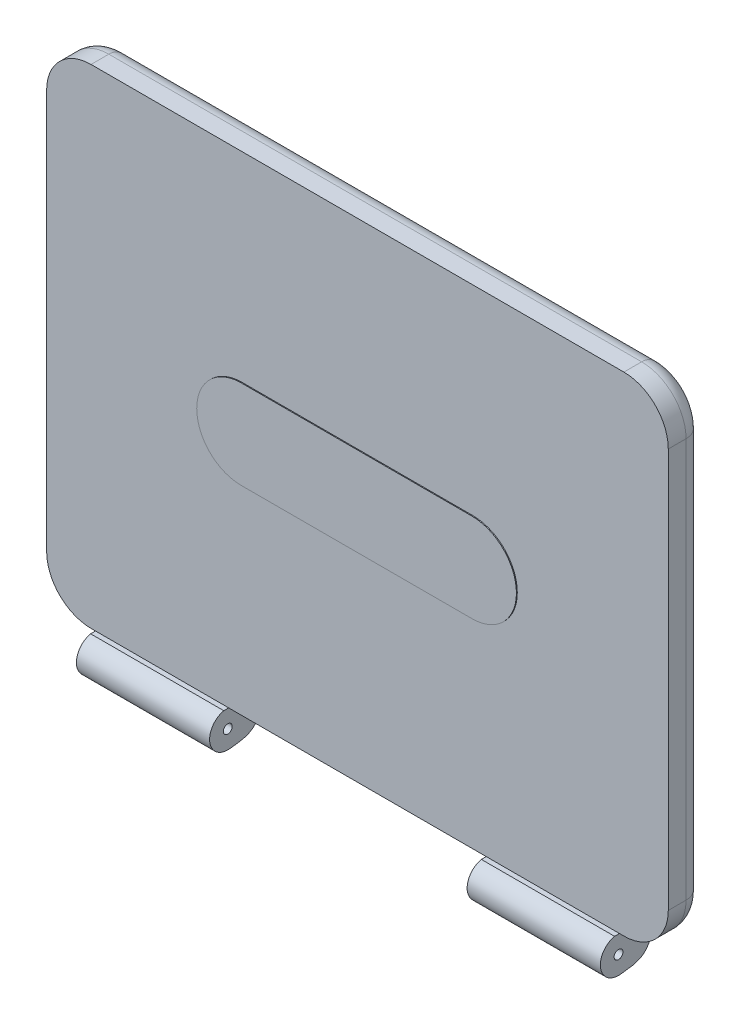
ISO-10303-21;
HEADER;
FILE_DESCRIPTION(('STEP AP214'),'2;1');
FILE_NAME('part.step','',(''),(''),'','','');
FILE_SCHEMA(('AUTOMOTIVE_DESIGN { 1 0 10303 214 1 1 1 1 }'));
ENDSEC;
DATA;
#1=APPLICATION_CONTEXT('core data for automotive mechanical design processes');
#2=APPLICATION_PROTOCOL_DEFINITION('international standard','automotive_design',2000,#1);
#3=PRODUCT_CONTEXT('',#1,'mechanical');
#4=PRODUCT('Part','Part','',(#3));
#5=PRODUCT_RELATED_PRODUCT_CATEGORY('part','',(#4));
#6=PRODUCT_DEFINITION_FORMATION('','',#4);
#7=PRODUCT_DEFINITION_CONTEXT('part definition',#1,'design');
#8=PRODUCT_DEFINITION('design','',#6,#7);
#9=PRODUCT_DEFINITION_SHAPE('','',#8);
#10=(LENGTH_UNIT() NAMED_UNIT(*) SI_UNIT(.MILLI.,.METRE.));
#11=(NAMED_UNIT(*) PLANE_ANGLE_UNIT() SI_UNIT($,.RADIAN.));
#12=(NAMED_UNIT(*) SI_UNIT($,.STERADIAN.) SOLID_ANGLE_UNIT());
#13=UNCERTAINTY_MEASURE_WITH_UNIT(LENGTH_MEASURE(1.E-05),#10,'distance_accuracy_value','');
#14=(GEOMETRIC_REPRESENTATION_CONTEXT(3) GLOBAL_UNCERTAINTY_ASSIGNED_CONTEXT((#13)) GLOBAL_UNIT_ASSIGNED_CONTEXT((#10,
#11,#12)) REPRESENTATION_CONTEXT('',''));
#15=CARTESIAN_POINT('',(0.,0.,0.));
#16=DIRECTION('',(0.,0.,1.));
#17=DIRECTION('',(1.,0.,0.));
#18=AXIS2_PLACEMENT_3D('',#15,#16,#17);
#19=CARTESIAN_POINT('',(5.00000000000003,0.,4.));
#20=DIRECTION('',(0.,1.,0.));
#21=DIRECTION('',(0.,0.,1.));
#22=AXIS2_PLACEMENT_3D('',#19,#20,#21);
#23=PLANE('',#22);
#24=DIRECTION('',(0.,0.,-1.));
#25=VECTOR('',#24,1.);
#26=CARTESIAN_POINT('',(5.49999999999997,0.,4.55000000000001));
#27=LINE('',#26,#25);
#28=CARTESIAN_POINT('',(5.49999999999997,0.,4.));
#29=VERTEX_POINT('',#28);
#30=CARTESIAN_POINT('',(5.49999999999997,0.,2.));
#31=VERTEX_POINT('',#30);
#32=EDGE_CURVE('E250',#29,#31,#27,.T.);
#33=ORIENTED_EDGE('',*,*,#32,.F.);
#34=DIRECTION('',(1.,0.,0.));
#35=VECTOR('',#34,1.);
#36=CARTESIAN_POINT('',(5.00000000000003,0.,4.));
#37=LINE('',#36,#35);
#38=CARTESIAN_POINT('',(5.00000000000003,0.,4.));
#39=VERTEX_POINT('',#38);
#40=EDGE_CURVE('E387',#39,#29,#37,.T.);
#41=ORIENTED_EDGE('',*,*,#40,.F.);
#42=DIRECTION('',(0.,0.,-1.));
#43=VECTOR('',#42,1.);
#44=CARTESIAN_POINT('',(5.00000000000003,0.,4.));
#45=LINE('',#44,#43);
#46=CARTESIAN_POINT('',(5.00000000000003,0.,2.));
#47=VERTEX_POINT('',#46);
#48=EDGE_CURVE('E424',#39,#47,#45,.T.);
#49=ORIENTED_EDGE('',*,*,#48,.T.);
#50=DIRECTION('',(1.,0.,0.));
#51=VECTOR('',#50,1.);
#52=CARTESIAN_POINT('',(65.,0.,2.));
#53=LINE('',#52,#51);
#54=EDGE_CURVE('E432',#47,#31,#53,.T.);
#55=ORIENTED_EDGE('',*,*,#54,.T.);
#56=EDGE_LOOP('',(#33,#41,#49,#55));
#57=FACE_BOUND('',#56,.T.);
#58=ADVANCED_FACE('F31',(#57),#23,.F.);
#59=CARTESIAN_POINT('',(20.5,0.,4.));
#60=VERTEX_POINT('',#59);
#61=CARTESIAN_POINT('',(49.5,0.,4.));
#62=VERTEX_POINT('',#61);
#63=EDGE_CURVE('E391',#60,#62,#37,.T.);
#64=ORIENTED_EDGE('',*,*,#63,.F.);
#65=DIRECTION('',(0.,0.,-1.));
#66=VECTOR('',#65,1.);
#67=CARTESIAN_POINT('',(20.5,0.,4.00000000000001));
#68=LINE('',#67,#66);
#69=CARTESIAN_POINT('',(20.5,0.,2.));
#70=VERTEX_POINT('',#69);
#71=EDGE_CURVE('E210',#60,#70,#68,.T.);
#72=ORIENTED_EDGE('',*,*,#71,.T.);
#73=CARTESIAN_POINT('',(49.5,0.,2.));
#74=VERTEX_POINT('',#73);
#75=EDGE_CURVE('E56',#70,#74,#53,.T.);
#76=ORIENTED_EDGE('',*,*,#75,.T.);
#77=DIRECTION('',(0.,0.,-1.));
#78=VECTOR('',#77,1.);
#79=CARTESIAN_POINT('',(49.5,0.,4.));
#80=LINE('',#79,#78);
#81=EDGE_CURVE('E321',#62,#74,#80,.T.);
#82=ORIENTED_EDGE('',*,*,#81,.F.);
#83=EDGE_LOOP('',(#64,#72,#76,#82));
#84=FACE_BOUND('',#83,.T.);
#85=ADVANCED_FACE('F558',(#84),#23,.F.);
#86=CARTESIAN_POINT('',(5.,5.,4.));
#87=DIRECTION('',(0.,0.,-1.));
#88=DIRECTION('',(-1.,0.,0.));
#89=AXIS2_PLACEMENT_3D('',#86,#87,#88);
#90=PLANE('',#89);
#91=CARTESIAN_POINT('',(5.,5.,4.));
#92=DIRECTION('',(0.,0.,1.));
#93=DIRECTION('',(-1.,0.,0.));
#94=AXIS2_PLACEMENT_3D('',#91,#92,#93);
#95=CIRCLE('',#94,5.);
#96=CARTESIAN_POINT('',(0.,5.00000000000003,4.));
#97=VERTEX_POINT('',#96);
#98=EDGE_CURVE('E383',#97,#39,#95,.T.);
#99=ORIENTED_EDGE('',*,*,#98,.T.);
#100=ORIENTED_EDGE('',*,*,#40,.T.);
#101=EDGE_CURVE('E223',#29,#60,#37,.T.);
#102=ORIENTED_EDGE('',*,*,#101,.T.);
#103=ORIENTED_EDGE('',*,*,#63,.T.);
#104=DIRECTION('',(-1.,0.,0.));
#105=VECTOR('',#104,1.);
#106=CARTESIAN_POINT('',(64.5,0.,4.));
#107=LINE('',#106,#105);
#108=CARTESIAN_POINT('',(64.5,0.,4.));
#109=VERTEX_POINT('',#108);
#110=EDGE_CURVE('E315',#109,#62,#107,.T.);
#111=ORIENTED_EDGE('',*,*,#110,.F.);
#112=CARTESIAN_POINT('',(65.,0.,4.));
#113=VERTEX_POINT('',#112);
#114=EDGE_CURVE('E386',#109,#113,#37,.T.);
#115=ORIENTED_EDGE('',*,*,#114,.T.);
#116=CARTESIAN_POINT('',(65.,5.,4.));
#117=DIRECTION('',(0.,0.,1.));
#118=DIRECTION('',(1.,0.,0.));
#119=AXIS2_PLACEMENT_3D('',#116,#117,#118);
#120=CIRCLE('',#119,5.);
#121=CARTESIAN_POINT('',(70.,5.00000000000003,4.));
#122=VERTEX_POINT('',#121);
#123=EDGE_CURVE('E390',#113,#122,#120,.T.);
#124=ORIENTED_EDGE('',*,*,#123,.T.);
#125=DIRECTION('',(0.,1.,0.));
#126=VECTOR('',#125,1.);
#127=CARTESIAN_POINT('',(70.,5.00000000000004,4.));
#128=LINE('',#127,#126);
#129=CARTESIAN_POINT('',(70.,50.,4.));
#130=VERTEX_POINT('',#129);
#131=EDGE_CURVE('E393',#122,#130,#128,.T.);
#132=ORIENTED_EDGE('',*,*,#131,.T.);
#133=CARTESIAN_POINT('',(65.,50.,4.));
#134=DIRECTION('',(0.,0.,1.));
#135=DIRECTION('',(-1.,0.,0.));
#136=AXIS2_PLACEMENT_3D('',#133,#134,#135);
#137=CIRCLE('',#136,5.);
#138=CARTESIAN_POINT('',(65.,55.,4.));
#139=VERTEX_POINT('',#138);
#140=EDGE_CURVE('E395',#130,#139,#137,.T.);
#141=ORIENTED_EDGE('',*,*,#140,.T.);
#142=DIRECTION('',(-1.,0.,0.));
#143=VECTOR('',#142,1.);
#144=CARTESIAN_POINT('',(5.00000000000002,55.,4.));
#145=LINE('',#144,#143);
#146=CARTESIAN_POINT('',(5.00000000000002,55.,4.));
#147=VERTEX_POINT('',#146);
#148=EDGE_CURVE('E397',#139,#147,#145,.T.);
#149=ORIENTED_EDGE('',*,*,#148,.T.);
#150=CARTESIAN_POINT('',(4.99999999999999,50.,4.));
#151=DIRECTION('',(0.,0.,1.));
#152=DIRECTION('',(-1.,0.,0.));
#153=AXIS2_PLACEMENT_3D('',#150,#151,#152);
#154=CIRCLE('',#153,5.);
#155=CARTESIAN_POINT('',(0.,50.,4.));
#156=VERTEX_POINT('',#155);
#157=EDGE_CURVE('E399',#147,#156,#154,.T.);
#158=ORIENTED_EDGE('',*,*,#157,.T.);
#159=DIRECTION('',(0.,-1.,0.));
#160=VECTOR('',#159,1.);
#161=CARTESIAN_POINT('',(0.,5.00000000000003,4.));
#162=LINE('',#161,#160);
#163=EDGE_CURVE('E401',#156,#97,#162,.T.);
#164=ORIENTED_EDGE('',*,*,#163,.T.);
#165=EDGE_LOOP('',(#99,#100,#102,#103,#111,#115,#124,#132,#141,#149,#158,#164));
#166=FACE_BOUND('',#165,.T.);
#167=CARTESIAN_POINT('',(22.,27.5,4.));
#168=DIRECTION('',(0.,0.,1.));
#169=DIRECTION('',(1.,0.,0.));
#170=AXIS2_PLACEMENT_3D('',#167,#168,#169);
#171=CIRCLE('',#170,4.99999999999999);
#172=CARTESIAN_POINT('',(22.,32.5,4.));
#173=VERTEX_POINT('',#172);
#174=CARTESIAN_POINT('',(22.,22.5,4.));
#175=VERTEX_POINT('',#174);
#176=EDGE_CURVE('E326',#173,#175,#171,.T.);
#177=ORIENTED_EDGE('',*,*,#176,.F.);
#178=DIRECTION('',(-1.,0.,0.));
#179=VECTOR('',#178,1.);
#180=CARTESIAN_POINT('',(22.,32.5,4.));
#181=LINE('',#180,#179);
#182=CARTESIAN_POINT('',(48.,32.5,4.));
#183=VERTEX_POINT('',#182);
#184=EDGE_CURVE('E335',#183,#173,#181,.T.);
#185=ORIENTED_EDGE('',*,*,#184,.F.);
#186=CARTESIAN_POINT('',(48.,27.5,4.));
#187=DIRECTION('',(0.,0.,1.));
#188=DIRECTION('',(1.,0.,0.));
#189=AXIS2_PLACEMENT_3D('',#186,#187,#188);
#190=CIRCLE('',#189,5.);
#191=CARTESIAN_POINT('',(48.,22.5,4.));
#192=VERTEX_POINT('',#191);
#193=EDGE_CURVE('E332',#192,#183,#190,.T.);
#194=ORIENTED_EDGE('',*,*,#193,.F.);
#195=DIRECTION('',(1.,0.,0.));
#196=VECTOR('',#195,1.);
#197=CARTESIAN_POINT('',(22.,22.5,4.));
#198=LINE('',#197,#196);
#199=EDGE_CURVE('E329',#175,#192,#198,.T.);
#200=ORIENTED_EDGE('',*,*,#199,.F.);
#201=EDGE_LOOP('',(#177,#185,#194,#200));
#202=FACE_BOUND('',#201,.T.);
#203=ADVANCED_FACE('F490',(#166,#202),#90,.F.);
#204=CARTESIAN_POINT('',(5.,5.,4.));
#205=DIRECTION('',(0.,0.,-1.));
#206=DIRECTION('',(-1.,0.,0.));
#207=AXIS2_PLACEMENT_3D('',#204,#205,#206);
#208=CYLINDRICAL_SURFACE('',#207,5.);
#209=DIRECTION('',(0.,0.,-1.));
#210=VECTOR('',#209,1.);
#211=CARTESIAN_POINT('',(0.,5.00000000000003,4.));
#212=LINE('',#211,#210);
#213=CARTESIAN_POINT('',(0.,5.00000000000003,2.));
#214=VERTEX_POINT('',#213);
#215=EDGE_CURVE('E403',#97,#214,#212,.T.);
#216=ORIENTED_EDGE('',*,*,#215,.T.);
#217=CARTESIAN_POINT('',(5.,5.,2.));
#218=DIRECTION('',(0.,0.,-1.));
#219=DIRECTION('',(-1.,0.,0.));
#220=AXIS2_PLACEMENT_3D('',#217,#218,#219);
#221=CIRCLE('',#220,5.);
#222=EDGE_CURVE('E440',#214,#47,#221,.F.);
#223=ORIENTED_EDGE('',*,*,#222,.T.);
#224=ORIENTED_EDGE('',*,*,#48,.F.);
#225=ORIENTED_EDGE('',*,*,#98,.F.);
#226=EDGE_LOOP('',(#216,#223,#224,#225));
#227=FACE_BOUND('',#226,.T.);
#228=ADVANCED_FACE('F33',(#227),#208,.T.);
#229=ORIENTED_EDGE('',*,*,#114,.F.);
#230=DIRECTION('',(0.,0.,-1.));
#231=VECTOR('',#230,1.);
#232=CARTESIAN_POINT('',(64.5,0.,3.99999999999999));
#233=LINE('',#232,#231);
#234=CARTESIAN_POINT('',(64.5,0.,2.));
#235=VERTEX_POINT('',#234);
#236=EDGE_CURVE('E323',#109,#235,#233,.T.);
#237=ORIENTED_EDGE('',*,*,#236,.T.);
#238=CARTESIAN_POINT('',(65.,0.,2.));
#239=VERTEX_POINT('',#238);
#240=EDGE_CURVE('E426',#235,#239,#53,.T.);
#241=ORIENTED_EDGE('',*,*,#240,.T.);
#242=DIRECTION('',(0.,0.,-1.));
#243=VECTOR('',#242,1.);
#244=CARTESIAN_POINT('',(65.,0.,4.));
#245=LINE('',#244,#243);
#246=EDGE_CURVE('E421',#113,#239,#245,.T.);
#247=ORIENTED_EDGE('',*,*,#246,.F.);
#248=EDGE_LOOP('',(#229,#237,#241,#247));
#249=FACE_BOUND('',#248,.T.);
#250=ADVANCED_FACE('F553',(#249),#23,.F.);
#251=CARTESIAN_POINT('',(65.,5.,4.));
#252=DIRECTION('',(0.,0.,-1.));
#253=DIRECTION('',(-1.,0.,0.));
#254=AXIS2_PLACEMENT_3D('',#251,#252,#253);
#255=CYLINDRICAL_SURFACE('',#254,5.);
#256=ORIENTED_EDGE('',*,*,#246,.T.);
#257=CARTESIAN_POINT('',(65.,5.,2.));
#258=DIRECTION('',(0.,0.,-1.));
#259=DIRECTION('',(-1.,0.,0.));
#260=AXIS2_PLACEMENT_3D('',#257,#258,#259);
#261=CIRCLE('',#260,5.);
#262=CARTESIAN_POINT('',(70.,5.00000000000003,2.));
#263=VERTEX_POINT('',#262);
#264=EDGE_CURVE('E452',#239,#263,#261,.F.);
#265=ORIENTED_EDGE('',*,*,#264,.T.);
#266=DIRECTION('',(0.,0.,-1.));
#267=VECTOR('',#266,1.);
#268=CARTESIAN_POINT('',(70.,5.00000000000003,4.));
#269=LINE('',#268,#267);
#270=EDGE_CURVE('E418',#122,#263,#269,.T.);
#271=ORIENTED_EDGE('',*,*,#270,.F.);
#272=ORIENTED_EDGE('',*,*,#123,.F.);
#273=EDGE_LOOP('',(#256,#265,#271,#272));
#274=FACE_BOUND('',#273,.T.);
#275=ADVANCED_FACE('F567',(#274),#255,.T.);
#276=CARTESIAN_POINT('',(70.,5.00000000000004,4.));
#277=DIRECTION('',(-1.,0.,0.));
#278=DIRECTION('',(0.,-1.,0.));
#279=AXIS2_PLACEMENT_3D('',#276,#277,#278);
#280=PLANE('',#279);
#281=ORIENTED_EDGE('',*,*,#270,.T.);
#282=DIRECTION('',(0.,1.,0.));
#283=VECTOR('',#282,1.);
#284=CARTESIAN_POINT('',(70.,50.,2.));
#285=LINE('',#284,#283);
#286=CARTESIAN_POINT('',(70.,50.,2.));
#287=VERTEX_POINT('',#286);
#288=EDGE_CURVE('E450',#263,#287,#285,.T.);
#289=ORIENTED_EDGE('',*,*,#288,.T.);
#290=DIRECTION('',(0.,0.,-1.));
#291=VECTOR('',#290,1.);
#292=CARTESIAN_POINT('',(70.,50.,4.));
#293=LINE('',#292,#291);
#294=EDGE_CURVE('E415',#130,#287,#293,.T.);
#295=ORIENTED_EDGE('',*,*,#294,.F.);
#296=ORIENTED_EDGE('',*,*,#131,.F.);
#297=EDGE_LOOP('',(#281,#289,#295,#296));
#298=FACE_BOUND('',#297,.T.);
#299=ADVANCED_FACE('F572',(#298),#280,.F.);
#300=CARTESIAN_POINT('',(65.,50.,4.));
#301=DIRECTION('',(0.,0.,-1.));
#302=DIRECTION('',(-1.,0.,0.));
#303=AXIS2_PLACEMENT_3D('',#300,#301,#302);
#304=CYLINDRICAL_SURFACE('',#303,5.);
#305=ORIENTED_EDGE('',*,*,#294,.T.);
#306=CARTESIAN_POINT('',(65.,50.,2.));
#307=DIRECTION('',(0.,0.,-1.));
#308=DIRECTION('',(-1.,0.,0.));
#309=AXIS2_PLACEMENT_3D('',#306,#307,#308);
#310=CIRCLE('',#309,5.);
#311=CARTESIAN_POINT('',(65.,55.,2.));
#312=VERTEX_POINT('',#311);
#313=EDGE_CURVE('E448',#287,#312,#310,.F.);
#314=ORIENTED_EDGE('',*,*,#313,.T.);
#315=DIRECTION('',(0.,0.,-1.));
#316=VECTOR('',#315,1.);
#317=CARTESIAN_POINT('',(65.,55.,4.));
#318=LINE('',#317,#316);
#319=EDGE_CURVE('E412',#139,#312,#318,.T.);
#320=ORIENTED_EDGE('',*,*,#319,.F.);
#321=ORIENTED_EDGE('',*,*,#140,.F.);
#322=EDGE_LOOP('',(#305,#314,#320,#321));
#323=FACE_BOUND('',#322,.T.);
#324=ADVANCED_FACE('F837',(#323),#304,.T.);
#325=CARTESIAN_POINT('',(5.00000000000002,55.,4.));
#326=DIRECTION('',(0.,-1.,0.));
#327=DIRECTION('',(0.,0.,-1.));
#328=AXIS2_PLACEMENT_3D('',#325,#326,#327);
#329=PLANE('',#328);
#330=ORIENTED_EDGE('',*,*,#319,.T.);
#331=DIRECTION('',(-1.,0.,0.));
#332=VECTOR('',#331,1.);
#333=CARTESIAN_POINT('',(5.00000000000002,55.,2.));
#334=LINE('',#333,#332);
#335=CARTESIAN_POINT('',(5.00000000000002,55.,2.));
#336=VERTEX_POINT('',#335);
#337=EDGE_CURVE('E446',#312,#336,#334,.T.);
#338=ORIENTED_EDGE('',*,*,#337,.T.);
#339=DIRECTION('',(0.,0.,-1.));
#340=VECTOR('',#339,1.);
#341=CARTESIAN_POINT('',(5.00000000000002,55.,4.));
#342=LINE('',#341,#340);
#343=EDGE_CURVE('E409',#147,#336,#342,.T.);
#344=ORIENTED_EDGE('',*,*,#343,.F.);
#345=ORIENTED_EDGE('',*,*,#148,.F.);
#346=EDGE_LOOP('',(#330,#338,#344,#345));
#347=FACE_BOUND('',#346,.T.);
#348=ADVANCED_FACE('F828',(#347),#329,.F.);
#349=CARTESIAN_POINT('',(4.99999999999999,50.,4.));
#350=DIRECTION('',(0.,0.,-1.));
#351=DIRECTION('',(-1.,0.,0.));
#352=AXIS2_PLACEMENT_3D('',#349,#350,#351);
#353=CYLINDRICAL_SURFACE('',#352,5.);
#354=ORIENTED_EDGE('',*,*,#343,.T.);
#355=CARTESIAN_POINT('',(4.99999999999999,50.,2.));
#356=DIRECTION('',(0.,0.,-1.));
#357=DIRECTION('',(-1.,0.,0.));
#358=AXIS2_PLACEMENT_3D('',#355,#356,#357);
#359=CIRCLE('',#358,5.);
#360=CARTESIAN_POINT('',(0.,50.,2.));
#361=VERTEX_POINT('',#360);
#362=EDGE_CURVE('E444',#336,#361,#359,.F.);
#363=ORIENTED_EDGE('',*,*,#362,.T.);
#364=DIRECTION('',(0.,0.,-1.));
#365=VECTOR('',#364,1.);
#366=CARTESIAN_POINT('',(0.,50.,4.));
#367=LINE('',#366,#365);
#368=EDGE_CURVE('E406',#156,#361,#367,.T.);
#369=ORIENTED_EDGE('',*,*,#368,.F.);
#370=ORIENTED_EDGE('',*,*,#157,.F.);
#371=EDGE_LOOP('',(#354,#363,#369,#370));
#372=FACE_BOUND('',#371,.T.);
#373=ADVANCED_FACE('F819',(#372),#353,.T.);
#374=CARTESIAN_POINT('',(0.,5.00000000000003,4.));
#375=DIRECTION('',(1.,0.,0.));
#376=DIRECTION('',(0.,1.,0.));
#377=AXIS2_PLACEMENT_3D('',#374,#375,#376);
#378=PLANE('',#377);
#379=ORIENTED_EDGE('',*,*,#368,.T.);
#380=DIRECTION('',(0.,-1.,0.));
#381=VECTOR('',#380,1.);
#382=CARTESIAN_POINT('',(0.,5.00000000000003,2.));
#383=LINE('',#382,#381);
#384=EDGE_CURVE('E442',#361,#214,#383,.T.);
#385=ORIENTED_EDGE('',*,*,#384,.T.);
#386=ORIENTED_EDGE('',*,*,#215,.F.);
#387=ORIENTED_EDGE('',*,*,#163,.F.);
#388=EDGE_LOOP('',(#379,#385,#386,#387));
#389=FACE_BOUND('',#388,.T.);
#390=ADVANCED_FACE('F496',(#389),#378,.F.);
#391=CARTESIAN_POINT('',(5.,5.,0.));
#392=DIRECTION('',(0.,0.,-1.));
#393=DIRECTION('',(-1.,0.,0.));
#394=AXIS2_PLACEMENT_3D('',#391,#392,#393);
#395=PLANE('',#394);
#396=CARTESIAN_POINT('',(65.,5.,0.));
#397=DIRECTION('',(0.,0.,-1.));
#398=DIRECTION('',(-1.,0.,0.));
#399=AXIS2_PLACEMENT_3D('',#396,#397,#398);
#400=CIRCLE('',#399,3.);
#401=CARTESIAN_POINT('',(68.,5.00000000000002,0.));
#402=VERTEX_POINT('',#401);
#403=CARTESIAN_POINT('',(65.,2.,0.));
#404=VERTEX_POINT('',#403);
#405=EDGE_CURVE('E456',#402,#404,#400,.T.);
#406=ORIENTED_EDGE('',*,*,#405,.T.);
#407=DIRECTION('',(1.,0.,0.));
#408=VECTOR('',#407,1.);
#409=CARTESIAN_POINT('',(5.00000000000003,2.,0.));
#410=LINE('',#409,#408);
#411=CARTESIAN_POINT('',(5.00000000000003,2.,0.));
#412=VERTEX_POINT('',#411);
#413=EDGE_CURVE('E454',#404,#412,#410,.F.);
#414=ORIENTED_EDGE('',*,*,#413,.T.);
#415=CARTESIAN_POINT('',(5.,5.,0.));
#416=DIRECTION('',(0.,0.,-1.));
#417=DIRECTION('',(-1.,0.,0.));
#418=AXIS2_PLACEMENT_3D('',#415,#416,#417);
#419=CIRCLE('',#418,3.);
#420=CARTESIAN_POINT('',(2.,5.00000000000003,0.));
#421=VERTEX_POINT('',#420);
#422=EDGE_CURVE('E429',#412,#421,#419,.T.);
#423=ORIENTED_EDGE('',*,*,#422,.T.);
#424=DIRECTION('',(0.,-1.,0.));
#425=VECTOR('',#424,1.);
#426=CARTESIAN_POINT('',(1.99999999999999,50.,0.));
#427=LINE('',#426,#425);
#428=CARTESIAN_POINT('',(1.99999999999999,50.,0.));
#429=VERTEX_POINT('',#428);
#430=EDGE_CURVE('E465',#421,#429,#427,.F.);
#431=ORIENTED_EDGE('',*,*,#430,.T.);
#432=CARTESIAN_POINT('',(4.99999999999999,50.,0.));
#433=DIRECTION('',(0.,0.,-1.));
#434=DIRECTION('',(-1.,0.,0.));
#435=AXIS2_PLACEMENT_3D('',#432,#433,#434);
#436=CIRCLE('',#435,3.);
#437=CARTESIAN_POINT('',(5.00000000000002,53.,0.));
#438=VERTEX_POINT('',#437);
#439=EDGE_CURVE('E464',#429,#438,#436,.T.);
#440=ORIENTED_EDGE('',*,*,#439,.T.);
#441=DIRECTION('',(-1.,0.,0.));
#442=VECTOR('',#441,1.);
#443=CARTESIAN_POINT('',(65.,53.,0.));
#444=LINE('',#443,#442);
#445=CARTESIAN_POINT('',(65.,53.,0.));
#446=VERTEX_POINT('',#445);
#447=EDGE_CURVE('E462',#438,#446,#444,.F.);
#448=ORIENTED_EDGE('',*,*,#447,.T.);
#449=CARTESIAN_POINT('',(65.,50.,0.));
#450=DIRECTION('',(0.,0.,-1.));
#451=DIRECTION('',(-1.,0.,0.));
#452=AXIS2_PLACEMENT_3D('',#449,#450,#451);
#453=CIRCLE('',#452,3.);
#454=CARTESIAN_POINT('',(68.,50.,0.));
#455=VERTEX_POINT('',#454);
#456=EDGE_CURVE('E460',#446,#455,#453,.T.);
#457=ORIENTED_EDGE('',*,*,#456,.T.);
#458=DIRECTION('',(0.,1.,0.));
#459=VECTOR('',#458,1.);
#460=CARTESIAN_POINT('',(68.,5.00000000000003,0.));
#461=LINE('',#460,#459);
#462=EDGE_CURVE('E458',#455,#402,#461,.F.);
#463=ORIENTED_EDGE('',*,*,#462,.T.);
#464=EDGE_LOOP('',(#406,#414,#423,#431,#440,#448,#457,#463));
#465=FACE_BOUND('',#464,.T.);
#466=ADVANCED_FACE('F470',(#465),#395,.T.);
#467=CARTESIAN_POINT('',(5.00000000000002,53.,2.));
#468=DIRECTION('',(1.,0.,0.));
#469=DIRECTION('',(0.,0.,-1.));
#470=AXIS2_PLACEMENT_3D('',#467,#468,#469);
#471=CYLINDRICAL_SURFACE('',#470,2.);
#472=CARTESIAN_POINT('',(65.,53.,2.));
#473=DIRECTION('',(1.,0.,0.));
#474=DIRECTION('',(0.,1.,0.));
#475=AXIS2_PLACEMENT_3D('',#472,#473,#474);
#476=CIRCLE('',#475,2.);
#477=EDGE_CURVE('E377',#446,#312,#476,.T.);
#478=ORIENTED_EDGE('',*,*,#477,.F.);
#479=ORIENTED_EDGE('',*,*,#447,.F.);
#480=CARTESIAN_POINT('',(5.00000000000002,53.,2.));
#481=DIRECTION('',(-1.,0.,0.));
#482=DIRECTION('',(0.,0.,1.));
#483=AXIS2_PLACEMENT_3D('',#480,#481,#482);
#484=CIRCLE('',#483,2.);
#485=EDGE_CURVE('E380',#336,#438,#484,.T.);
#486=ORIENTED_EDGE('',*,*,#485,.F.);
#487=ORIENTED_EDGE('',*,*,#337,.F.);
#488=EDGE_LOOP('',(#478,#479,#486,#487));
#489=FACE_BOUND('',#488,.T.);
#490=ADVANCED_FACE('F505',(#489),#471,.T.);
#491=CARTESIAN_POINT('',(4.99999999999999,50.,2.));
#492=DIRECTION('',(0.,0.,-1.));
#493=DIRECTION('',(-1.,0.,0.));
#494=AXIS2_PLACEMENT_3D('',#491,#492,#493);
#495=TOROIDAL_SURFACE('',#494,3.,2.);
#496=ORIENTED_EDGE('',*,*,#485,.T.);
#497=ORIENTED_EDGE('',*,*,#439,.F.);
#498=CARTESIAN_POINT('',(1.99999999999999,50.,2.));
#499=DIRECTION('',(0.,-1.,0.));
#500=DIRECTION('',(1.,0.,0.));
#501=AXIS2_PLACEMENT_3D('',#498,#499,#500);
#502=CIRCLE('',#501,2.);
#503=EDGE_CURVE('E374',#361,#429,#502,.T.);
#504=ORIENTED_EDGE('',*,*,#503,.F.);
#505=ORIENTED_EDGE('',*,*,#362,.F.);
#506=EDGE_LOOP('',(#496,#497,#504,#505));
#507=FACE_BOUND('',#506,.T.);
#508=ADVANCED_FACE('F500',(#507),#495,.T.);
#509=CARTESIAN_POINT('',(65.,50.,2.));
#510=DIRECTION('',(0.,0.,-1.));
#511=DIRECTION('',(-1.,0.,0.));
#512=AXIS2_PLACEMENT_3D('',#509,#510,#511);
#513=TOROIDAL_SURFACE('',#512,3.,2.);
#514=ORIENTED_EDGE('',*,*,#477,.T.);
#515=ORIENTED_EDGE('',*,*,#313,.F.);
#516=CARTESIAN_POINT('',(68.,50.,2.));
#517=DIRECTION('',(0.,-1.,0.));
#518=DIRECTION('',(0.,0.,-1.));
#519=AXIS2_PLACEMENT_3D('',#516,#517,#518);
#520=CIRCLE('',#519,2.);
#521=EDGE_CURVE('E371',#455,#287,#520,.T.);
#522=ORIENTED_EDGE('',*,*,#521,.F.);
#523=ORIENTED_EDGE('',*,*,#456,.F.);
#524=EDGE_LOOP('',(#514,#515,#522,#523));
#525=FACE_BOUND('',#524,.T.);
#526=ADVANCED_FACE('F511',(#525),#513,.T.);
#527=CARTESIAN_POINT('',(2.,5.00000000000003,2.));
#528=DIRECTION('',(0.,1.,0.));
#529=DIRECTION('',(-1.,0.,0.));
#530=AXIS2_PLACEMENT_3D('',#527,#528,#529);
#531=CYLINDRICAL_SURFACE('',#530,2.);
#532=ORIENTED_EDGE('',*,*,#503,.T.);
#533=ORIENTED_EDGE('',*,*,#430,.F.);
#534=CARTESIAN_POINT('',(2.,5.00000000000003,2.));
#535=DIRECTION('',(0.,-1.,0.));
#536=DIRECTION('',(1.,0.,0.));
#537=AXIS2_PLACEMENT_3D('',#534,#535,#536);
#538=CIRCLE('',#537,2.);
#539=EDGE_CURVE('E368',#214,#421,#538,.T.);
#540=ORIENTED_EDGE('',*,*,#539,.F.);
#541=ORIENTED_EDGE('',*,*,#384,.F.);
#542=EDGE_LOOP('',(#532,#533,#540,#541));
#543=FACE_BOUND('',#542,.T.);
#544=ADVANCED_FACE('F476',(#543),#531,.T.);
#545=CARTESIAN_POINT('',(68.,5.00000000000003,2.));
#546=DIRECTION('',(0.,-1.,0.));
#547=DIRECTION('',(1.,0.,0.));
#548=AXIS2_PLACEMENT_3D('',#545,#546,#547);
#549=CYLINDRICAL_SURFACE('',#548,2.);
#550=ORIENTED_EDGE('',*,*,#521,.T.);
#551=ORIENTED_EDGE('',*,*,#288,.F.);
#552=CARTESIAN_POINT('',(68.,5.00000000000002,2.));
#553=DIRECTION('',(0.,-1.,0.));
#554=DIRECTION('',(1.,0.,0.));
#555=AXIS2_PLACEMENT_3D('',#552,#553,#554);
#556=CIRCLE('',#555,2.);
#557=EDGE_CURVE('E365',#402,#263,#556,.T.);
#558=ORIENTED_EDGE('',*,*,#557,.F.);
#559=ORIENTED_EDGE('',*,*,#462,.F.);
#560=EDGE_LOOP('',(#550,#551,#558,#559));
#561=FACE_BOUND('',#560,.T.);
#562=ADVANCED_FACE('F517',(#561),#549,.T.);
#563=CARTESIAN_POINT('',(5.,5.,2.));
#564=DIRECTION('',(0.,0.,-1.));
#565=DIRECTION('',(-1.,0.,0.));
#566=AXIS2_PLACEMENT_3D('',#563,#564,#565);
#567=TOROIDAL_SURFACE('',#566,3.,2.);
#568=ORIENTED_EDGE('',*,*,#539,.T.);
#569=ORIENTED_EDGE('',*,*,#422,.F.);
#570=CARTESIAN_POINT('',(5.00000000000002,2.,2.));
#571=DIRECTION('',(1.,0.,0.));
#572=DIRECTION('',(0.,0.,-1.));
#573=AXIS2_PLACEMENT_3D('',#570,#571,#572);
#574=CIRCLE('',#573,2.);
#575=EDGE_CURVE('E362',#47,#412,#574,.T.);
#576=ORIENTED_EDGE('',*,*,#575,.F.);
#577=ORIENTED_EDGE('',*,*,#222,.F.);
#578=EDGE_LOOP('',(#568,#569,#576,#577));
#579=FACE_BOUND('',#578,.T.);
#580=ADVANCED_FACE('F480',(#579),#567,.T.);
#581=CARTESIAN_POINT('',(65.,5.,2.));
#582=DIRECTION('',(0.,0.,-1.));
#583=DIRECTION('',(-1.,0.,0.));
#584=AXIS2_PLACEMENT_3D('',#581,#582,#583);
#585=TOROIDAL_SURFACE('',#584,3.,2.);
#586=ORIENTED_EDGE('',*,*,#557,.T.);
#587=ORIENTED_EDGE('',*,*,#264,.F.);
#588=CARTESIAN_POINT('',(65.,2.,2.));
#589=DIRECTION('',(-1.,0.,0.));
#590=DIRECTION('',(0.,0.,1.));
#591=AXIS2_PLACEMENT_3D('',#588,#589,#590);
#592=CIRCLE('',#591,2.);
#593=EDGE_CURVE('E359',#404,#239,#592,.T.);
#594=ORIENTED_EDGE('',*,*,#593,.F.);
#595=ORIENTED_EDGE('',*,*,#405,.F.);
#596=EDGE_LOOP('',(#586,#587,#594,#595));
#597=FACE_BOUND('',#596,.T.);
#598=ADVANCED_FACE('F521',(#597),#585,.T.);
#599=CARTESIAN_POINT('',(5.00000000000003,2.,2.));
#600=DIRECTION('',(-1.,0.,0.));
#601=DIRECTION('',(0.,0.,1.));
#602=AXIS2_PLACEMENT_3D('',#599,#600,#601);
#603=CYLINDRICAL_SURFACE('',#602,2.);
#604=CARTESIAN_POINT('',(5.49999999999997,2.,2.));
#605=DIRECTION('',(1.,0.,0.));
#606=DIRECTION('',(0.,0.,1.));
#607=AXIS2_PLACEMENT_3D('',#604,#605,#606);
#608=CIRCLE('',#607,2.);
#609=CARTESIAN_POINT('',(5.49999999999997,1.91164594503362,0.00195256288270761));
#610=VERTEX_POINT('',#609);
#611=EDGE_CURVE('E254',#31,#610,#608,.T.);
#612=ORIENTED_EDGE('',*,*,#611,.F.);
#613=ORIENTED_EDGE('',*,*,#54,.F.);
#614=ORIENTED_EDGE('',*,*,#575,.T.);
#615=ORIENTED_EDGE('',*,*,#413,.F.);
#616=ORIENTED_EDGE('',*,*,#593,.T.);
#617=ORIENTED_EDGE('',*,*,#240,.F.);
#618=CARTESIAN_POINT('',(64.5,2.,2.));
#619=DIRECTION('',(1.,0.,0.));
#620=DIRECTION('',(0.,1.,0.));
#621=AXIS2_PLACEMENT_3D('',#618,#619,#620);
#622=CIRCLE('',#621,2.);
#623=CARTESIAN_POINT('',(64.5,1.91164594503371,0.00195256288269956));
#624=VERTEX_POINT('',#623);
#625=EDGE_CURVE('E11',#624,#235,#622,.F.);
#626=ORIENTED_EDGE('',*,*,#625,.F.);
#627=DIRECTION('',(-1.,0.,0.));
#628=VECTOR('',#627,1.);
#629=CARTESIAN_POINT('',(64.5,1.91164594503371,0.00195256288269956));
#630=LINE('',#629,#628);
#631=CARTESIAN_POINT('',(49.5,1.91164594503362,0.001952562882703));
#632=VERTEX_POINT('',#631);
#633=EDGE_CURVE('E40',#624,#632,#630,.T.);
#634=ORIENTED_EDGE('',*,*,#633,.T.);
#635=CARTESIAN_POINT('',(49.5,2.,2.));
#636=DIRECTION('',(1.,0.,0.));
#637=DIRECTION('',(0.,1.,0.));
#638=AXIS2_PLACEMENT_3D('',#635,#636,#637);
#639=CIRCLE('',#638,2.);
#640=EDGE_CURVE('E437',#632,#74,#639,.F.);
#641=ORIENTED_EDGE('',*,*,#640,.T.);
#642=ORIENTED_EDGE('',*,*,#75,.F.);
#643=CARTESIAN_POINT('',(20.5,2.,2.));
#644=DIRECTION('',(1.,0.,0.));
#645=DIRECTION('',(0.,0.,1.));
#646=AXIS2_PLACEMENT_3D('',#643,#644,#645);
#647=CIRCLE('',#646,2.);
#648=CARTESIAN_POINT('',(20.5,1.9116459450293,0.00195256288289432));
#649=VERTEX_POINT('',#648);
#650=EDGE_CURVE('E213',#70,#649,#647,.T.);
#651=ORIENTED_EDGE('',*,*,#650,.T.);
#652=DIRECTION('',(1.,0.,0.));
#653=VECTOR('',#652,1.);
#654=CARTESIAN_POINT('',(5.49999999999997,1.91164594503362,0.00195256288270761));
#655=LINE('',#654,#653);
#656=EDGE_CURVE('E224',#610,#649,#655,.T.);
#657=ORIENTED_EDGE('',*,*,#656,.F.);
#658=EDGE_LOOP('',(#612,#613,#614,#615,#616,#617,#626,#634,#641,#642,#651,#657));
#659=FACE_BOUND('',#658,.T.);
#660=ADVANCED_FACE('F525',(#659),#603,.T.);
#661=CARTESIAN_POINT('',(22.,27.5,4.1));
#662=DIRECTION('',(0.,0.,-1.));
#663=DIRECTION('',(-1.,0.,0.));
#664=AXIS2_PLACEMENT_3D('',#661,#662,#663);
#665=CYLINDRICAL_SURFACE('',#664,4.99999999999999);
#666=ORIENTED_EDGE('',*,*,#176,.T.);
#667=DIRECTION('',(0.,0.,-1.));
#668=VECTOR('',#667,1.);
#669=CARTESIAN_POINT('',(22.,22.5,4.1));
#670=LINE('',#669,#668);
#671=CARTESIAN_POINT('',(22.,22.5,4.1));
#672=VERTEX_POINT('',#671);
#673=EDGE_CURVE('E356',#672,#175,#670,.T.);
#674=ORIENTED_EDGE('',*,*,#673,.F.);
#675=CARTESIAN_POINT('',(22.,27.5,4.1));
#676=DIRECTION('',(0.,0.,1.));
#677=DIRECTION('',(1.,0.,0.));
#678=AXIS2_PLACEMENT_3D('',#675,#676,#677);
#679=CIRCLE('',#678,4.99999999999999);
#680=CARTESIAN_POINT('',(22.,32.5,4.1));
#681=VERTEX_POINT('',#680);
#682=EDGE_CURVE('E338',#681,#672,#679,.T.);
#683=ORIENTED_EDGE('',*,*,#682,.F.);
#684=DIRECTION('',(0.,0.,-1.));
#685=VECTOR('',#684,1.);
#686=CARTESIAN_POINT('',(22.,32.5,4.1));
#687=LINE('',#686,#685);
#688=EDGE_CURVE('E347',#681,#173,#687,.T.);
#689=ORIENTED_EDGE('',*,*,#688,.T.);
#690=EDGE_LOOP('',(#666,#674,#683,#689));
#691=FACE_BOUND('',#690,.T.);
#692=ADVANCED_FACE('F594',(#691),#665,.T.);
#693=CARTESIAN_POINT('',(22.,22.5,4.1));
#694=DIRECTION('',(0.,1.,0.));
#695=DIRECTION('',(-1.,0.,0.));
#696=AXIS2_PLACEMENT_3D('',#693,#694,#695);
#697=PLANE('',#696);
#698=ORIENTED_EDGE('',*,*,#199,.T.);
#699=DIRECTION('',(0.,0.,-1.));
#700=VECTOR('',#699,1.);
#701=CARTESIAN_POINT('',(48.,22.5,4.1));
#702=LINE('',#701,#700);
#703=CARTESIAN_POINT('',(48.,22.5,4.1));
#704=VERTEX_POINT('',#703);
#705=EDGE_CURVE('E353',#704,#192,#702,.T.);
#706=ORIENTED_EDGE('',*,*,#705,.F.);
#707=DIRECTION('',(1.,0.,0.));
#708=VECTOR('',#707,1.);
#709=CARTESIAN_POINT('',(22.,22.5,4.1));
#710=LINE('',#709,#708);
#711=EDGE_CURVE('E341',#672,#704,#710,.T.);
#712=ORIENTED_EDGE('',*,*,#711,.F.);
#713=ORIENTED_EDGE('',*,*,#673,.T.);
#714=EDGE_LOOP('',(#698,#706,#712,#713));
#715=FACE_BOUND('',#714,.T.);
#716=ADVANCED_FACE('F743',(#715),#697,.F.);
#717=CARTESIAN_POINT('',(48.,27.5,4.1));
#718=DIRECTION('',(0.,0.,-1.));
#719=DIRECTION('',(-1.,0.,0.));
#720=AXIS2_PLACEMENT_3D('',#717,#718,#719);
#721=CYLINDRICAL_SURFACE('',#720,5.);
#722=ORIENTED_EDGE('',*,*,#193,.T.);
#723=DIRECTION('',(0.,0.,-1.));
#724=VECTOR('',#723,1.);
#725=CARTESIAN_POINT('',(48.,32.5,4.1));
#726=LINE('',#725,#724);
#727=CARTESIAN_POINT('',(48.,32.5,4.1));
#728=VERTEX_POINT('',#727);
#729=EDGE_CURVE('E350',#728,#183,#726,.T.);
#730=ORIENTED_EDGE('',*,*,#729,.F.);
#731=CARTESIAN_POINT('',(48.,27.5,4.1));
#732=DIRECTION('',(0.,0.,1.));
#733=DIRECTION('',(1.,0.,0.));
#734=AXIS2_PLACEMENT_3D('',#731,#732,#733);
#735=CIRCLE('',#734,5.);
#736=EDGE_CURVE('E343',#704,#728,#735,.T.);
#737=ORIENTED_EDGE('',*,*,#736,.F.);
#738=ORIENTED_EDGE('',*,*,#705,.T.);
#739=EDGE_LOOP('',(#722,#730,#737,#738));
#740=FACE_BOUND('',#739,.T.);
#741=ADVANCED_FACE('F733',(#740),#721,.T.);
#742=CARTESIAN_POINT('',(22.,32.5,4.1));
#743=DIRECTION('',(0.,-1.,0.));
#744=DIRECTION('',(1.,0.,0.));
#745=AXIS2_PLACEMENT_3D('',#742,#743,#744);
#746=PLANE('',#745);
#747=ORIENTED_EDGE('',*,*,#184,.T.);
#748=ORIENTED_EDGE('',*,*,#688,.F.);
#749=DIRECTION('',(-1.,0.,0.));
#750=VECTOR('',#749,1.);
#751=CARTESIAN_POINT('',(22.,32.5,4.1));
#752=LINE('',#751,#750);
#753=EDGE_CURVE('E345',#728,#681,#752,.T.);
#754=ORIENTED_EDGE('',*,*,#753,.F.);
#755=ORIENTED_EDGE('',*,*,#729,.T.);
#756=EDGE_LOOP('',(#747,#748,#754,#755));
#757=FACE_BOUND('',#756,.T.);
#758=ADVANCED_FACE('F724',(#757),#746,.F.);
#759=CARTESIAN_POINT('',(22.,27.5,4.1));
#760=DIRECTION('',(0.,0.,1.));
#761=DIRECTION('',(1.,0.,0.));
#762=AXIS2_PLACEMENT_3D('',#759,#760,#761);
#763=PLANE('',#762);
#764=ORIENTED_EDGE('',*,*,#682,.T.);
#765=ORIENTED_EDGE('',*,*,#711,.T.);
#766=ORIENTED_EDGE('',*,*,#736,.T.);
#767=ORIENTED_EDGE('',*,*,#753,.T.);
#768=EDGE_LOOP('',(#764,#765,#766,#767));
#769=FACE_BOUND('',#768,.T.);
#770=ADVANCED_FACE('F287',(#769),#763,.T.);
#771=CARTESIAN_POINT('',(64.5,-2.00000000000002,4.10000000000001));
#772=DIRECTION('',(1.,0.,0.));
#773=DIRECTION('',(0.,1.,0.));
#774=AXIS2_PLACEMENT_3D('',#771,#772,#773);
#775=PLANE('',#774);
#776=CARTESIAN_POINT('',(64.5,-2.00000000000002,4.10000000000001));
#777=DIRECTION('',(1.,0.,0.));
#778=DIRECTION('',(0.,1.,0.));
#779=AXIS2_PLACEMENT_3D('',#776,#777,#778);
#780=CIRCLE('',#779,0.5);
#781=CARTESIAN_POINT('',(64.5,-1.50000000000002,4.10000000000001));
#782=VERTEX_POINT('',#781);
#783=EDGE_CURVE('E674',#782,#782,#780,.T.);
#784=ORIENTED_EDGE('',*,*,#783,.F.);
#785=EDGE_LOOP('',(#784));
#786=FACE_BOUND('',#785,.T.);
#787=ORIENTED_EDGE('',*,*,#236,.F.);
#788=DIRECTION('',(0.,0.,1.));
#789=VECTOR('',#788,1.);
#790=CARTESIAN_POINT('',(64.5,0.,4.55000000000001));
#791=LINE('',#790,#789);
#792=CARTESIAN_POINT('',(64.5,0.,4.55000000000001));
#793=VERTEX_POINT('',#792);
#794=EDGE_CURVE('E305',#109,#793,#791,.T.);
#795=ORIENTED_EDGE('',*,*,#794,.T.);
#796=CARTESIAN_POINT('',(64.5,-2.00000000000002,4.10000000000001));
#797=DIRECTION('',(1.,0.,0.));
#798=DIRECTION('',(0.,1.,0.));
#799=AXIS2_PLACEMENT_3D('',#796,#797,#798);
#800=CIRCLE('',#799,2.05);
#801=CARTESIAN_POINT('',(64.5,-4.03746165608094,3.87361537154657));
#802=VERTEX_POINT('',#801);
#803=EDGE_CURVE('E306',#793,#802,#800,.T.);
#804=ORIENTED_EDGE('',*,*,#803,.T.);
#805=CARTESIAN_POINT('',(64.5,-4.03746165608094,3.87361537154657));
#806=CARTESIAN_POINT('',(64.5,-3.95182525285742,3.03202251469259));
#807=CARTESIAN_POINT('',(64.5,-3.65600131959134,0.124808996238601));
#808=CARTESIAN_POINT('',(64.5,-0.349395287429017,0.0518432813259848));
#809=CARTESIAN_POINT('',(64.5,2.,0.));
#810=B_SPLINE_CURVE_WITH_KNOTS('',3,(#805,#806,#807,#808,#809),.UNSPECIFIED.,.F.,.F.,(4,1,4),
(0.,0.289484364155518,1.),.UNSPECIFIED.);
#811=EDGE_CURVE('E298',#802,#624,#810,.T.);
#812=ORIENTED_EDGE('',*,*,#811,.T.);
#813=ORIENTED_EDGE('',*,*,#625,.T.);
#814=EDGE_LOOP('',(#787,#795,#804,#812,#813));
#815=FACE_BOUND('',#814,.T.);
#816=ADVANCED_FACE('F283',(#786,#815),#775,.T.);
#817=CARTESIAN_POINT('',(49.5,-2.00000000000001,4.10000000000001));
#818=DIRECTION('',(1.,0.,0.));
#819=DIRECTION('',(0.,1.,0.));
#820=AXIS2_PLACEMENT_3D('',#817,#818,#819);
#821=PLANE('',#820);
#822=CARTESIAN_POINT('',(49.5,-2.00000000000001,4.10000000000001));
#823=DIRECTION('',(1.,0.,0.));
#824=DIRECTION('',(0.,1.,0.));
#825=AXIS2_PLACEMENT_3D('',#822,#823,#824);
#826=CIRCLE('',#825,0.5);
#827=CARTESIAN_POINT('',(49.5,-1.50000000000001,4.10000000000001));
#828=VERTEX_POINT('',#827);
#829=EDGE_CURVE('E230',#828,#828,#826,.T.);
#830=ORIENTED_EDGE('',*,*,#829,.T.);
#831=EDGE_LOOP('',(#830));
#832=FACE_BOUND('',#831,.T.);
#833=DIRECTION('',(0.,0.,1.));
#834=VECTOR('',#833,1.);
#835=CARTESIAN_POINT('',(49.5,0.,4.55000000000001));
#836=LINE('',#835,#834);
#837=CARTESIAN_POINT('',(49.5,0.,4.55000000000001));
#838=VERTEX_POINT('',#837);
#839=EDGE_CURVE('E538',#62,#838,#836,.T.);
#840=ORIENTED_EDGE('',*,*,#839,.F.);
#841=ORIENTED_EDGE('',*,*,#81,.T.);
#842=ORIENTED_EDGE('',*,*,#640,.F.);
#843=CARTESIAN_POINT('',(49.5,-4.03746165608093,3.87361537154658));
#844=CARTESIAN_POINT('',(49.5,-3.95182525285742,3.03202251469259));
#845=CARTESIAN_POINT('',(49.5,-3.65600131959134,0.124808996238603));
#846=CARTESIAN_POINT('',(49.5,-0.349395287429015,0.0518432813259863));
#847=CARTESIAN_POINT('',(49.5,2.,0.));
#848=B_SPLINE_CURVE_WITH_KNOTS('',3,(#843,#844,#845,#846,#847),.UNSPECIFIED.,.F.,.F.,(4,1,4),
(0.,0.289484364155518,1.),.UNSPECIFIED.);
#849=CARTESIAN_POINT('',(49.5,-4.03746165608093,3.87361537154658));
#850=VERTEX_POINT('',#849);
#851=EDGE_CURVE('E534',#850,#632,#848,.T.);
#852=ORIENTED_EDGE('',*,*,#851,.F.);
#853=CARTESIAN_POINT('',(49.5,-2.00000000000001,4.10000000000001));
#854=DIRECTION('',(1.,0.,0.));
#855=DIRECTION('',(0.,1.,0.));
#856=AXIS2_PLACEMENT_3D('',#853,#854,#855);
#857=CIRCLE('',#856,2.05);
#858=EDGE_CURVE('E531',#838,#850,#857,.T.);
#859=ORIENTED_EDGE('',*,*,#858,.F.);
#860=EDGE_LOOP('',(#840,#841,#842,#852,#859));
#861=FACE_BOUND('',#860,.T.);
#862=ADVANCED_FACE('F279',(#832,#861),#821,.F.);
#863=CARTESIAN_POINT('',(64.5,-2.00000000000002,4.10000000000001));
#864=DIRECTION('',(-1.,0.,0.));
#865=DIRECTION('',(0.,-1.,0.));
#866=AXIS2_PLACEMENT_3D('',#863,#864,#865);
#867=CYLINDRICAL_SURFACE('',#866,2.05);
#868=ORIENTED_EDGE('',*,*,#858,.T.);
#869=DIRECTION('',(-1.,0.,0.));
#870=VECTOR('',#869,1.);
#871=CARTESIAN_POINT('',(64.5,-4.03746165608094,3.87361537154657));
#872=LINE('',#871,#870);
#873=EDGE_CURVE('E318',#802,#850,#872,.T.);
#874=ORIENTED_EDGE('',*,*,#873,.F.);
#875=ORIENTED_EDGE('',*,*,#803,.F.);
#876=DIRECTION('',(-1.,0.,0.));
#877=VECTOR('',#876,1.);
#878=CARTESIAN_POINT('',(64.5,0.,4.55000000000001));
#879=LINE('',#878,#877);
#880=EDGE_CURVE('E312',#793,#838,#879,.T.);
#881=ORIENTED_EDGE('',*,*,#880,.T.);
#882=EDGE_LOOP('',(#868,#874,#875,#881));
#883=FACE_BOUND('',#882,.T.);
#884=ADVANCED_FACE('F282',(#883),#867,.T.);
#885=DIRECTION('',(-1.,0.,0.));
#886=VECTOR('',#885,1.);
#887=SURFACE_OF_LINEAR_EXTRUSION('',#810,#886);
#888=ORIENTED_EDGE('',*,*,#633,.F.);
#889=ORIENTED_EDGE('',*,*,#811,.F.);
#890=ORIENTED_EDGE('',*,*,#873,.T.);
#891=ORIENTED_EDGE('',*,*,#851,.T.);
#892=EDGE_LOOP('',(#888,#889,#890,#891));
#893=FACE_BOUND('',#892,.T.);
#894=ADVANCED_FACE('F291',(#893),#887,.F.);
#895=CARTESIAN_POINT('',(64.5,0.,4.55000000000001));
#896=DIRECTION('',(0.,-1.,0.));
#897=DIRECTION('',(0.,0.,-1.));
#898=AXIS2_PLACEMENT_3D('',#895,#896,#897);
#899=PLANE('',#898);
#900=ORIENTED_EDGE('',*,*,#839,.T.);
#901=ORIENTED_EDGE('',*,*,#880,.F.);
#902=ORIENTED_EDGE('',*,*,#794,.F.);
#903=ORIENTED_EDGE('',*,*,#110,.T.);
#904=EDGE_LOOP('',(#900,#901,#902,#903));
#905=FACE_BOUND('',#904,.T.);
#906=ADVANCED_FACE('F278',(#905),#899,.F.);
#907=CARTESIAN_POINT('',(5.49999999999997,-2.00000000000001,4.10000000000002));
#908=DIRECTION('',(1.,0.,0.));
#909=DIRECTION('',(0.,0.,-1.));
#910=AXIS2_PLACEMENT_3D('',#907,#908,#909);
#911=CYLINDRICAL_SURFACE('',#910,2.05);
#912=CARTESIAN_POINT('',(20.5,-2.00000000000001,4.10000000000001));
#913=DIRECTION('',(-1.,0.,0.));
#914=DIRECTION('',(0.,0.,1.));
#915=AXIS2_PLACEMENT_3D('',#912,#913,#914);
#916=CIRCLE('',#915,2.05);
#917=CARTESIAN_POINT('',(20.5,-4.03746165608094,3.87361537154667));
#918=VERTEX_POINT('',#917);
#919=CARTESIAN_POINT('',(20.5,0.,4.55000000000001));
#920=VERTEX_POINT('',#919);
#921=EDGE_CURVE('E209',#918,#920,#916,.T.);
#922=ORIENTED_EDGE('',*,*,#921,.T.);
#923=DIRECTION('',(1.,0.,0.));
#924=VECTOR('',#923,1.);
#925=CARTESIAN_POINT('',(5.49999999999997,0.,4.55000000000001));
#926=LINE('',#925,#924);
#927=CARTESIAN_POINT('',(5.49999999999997,0.,4.55000000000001));
#928=VERTEX_POINT('',#927);
#929=EDGE_CURVE('E216',#928,#920,#926,.T.);
#930=ORIENTED_EDGE('',*,*,#929,.F.);
#931=CARTESIAN_POINT('',(5.49999999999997,-2.00000000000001,4.10000000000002));
#932=DIRECTION('',(-1.,0.,0.));
#933=DIRECTION('',(0.,0.,1.));
#934=AXIS2_PLACEMENT_3D('',#931,#932,#933);
#935=CIRCLE('',#934,2.05);
#936=CARTESIAN_POINT('',(5.49999999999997,-4.03746165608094,3.87361537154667));
#937=VERTEX_POINT('',#936);
#938=EDGE_CURVE('E253',#937,#928,#935,.T.);
#939=ORIENTED_EDGE('',*,*,#938,.F.);
#940=DIRECTION('',(1.,0.,0.));
#941=VECTOR('',#940,1.);
#942=CARTESIAN_POINT('',(5.49999999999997,-4.03746165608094,3.87361537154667));
#943=LINE('',#942,#941);
#944=EDGE_CURVE('E229',#937,#918,#943,.T.);
#945=ORIENTED_EDGE('',*,*,#944,.T.);
#946=EDGE_LOOP('',(#922,#930,#939,#945));
#947=FACE_BOUND('',#946,.T.);
#948=ADVANCED_FACE('F227',(#947),#911,.T.);
#949=CARTESIAN_POINT('',(5.49999999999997,0.,4.00000000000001));
#950=DIRECTION('',(0.,-1.,0.));
#951=DIRECTION('',(0.,0.,-1.));
#952=AXIS2_PLACEMENT_3D('',#949,#950,#951);
#953=PLANE('',#952);
#954=ORIENTED_EDGE('',*,*,#101,.F.);
#955=EDGE_CURVE('E219',#928,#29,#27,.T.);
#956=ORIENTED_EDGE('',*,*,#955,.F.);
#957=ORIENTED_EDGE('',*,*,#929,.T.);
#958=EDGE_CURVE('E205',#920,#60,#68,.T.);
#959=ORIENTED_EDGE('',*,*,#958,.T.);
#960=EDGE_LOOP('',(#954,#956,#957,#959));
#961=FACE_BOUND('',#960,.T.);
#962=ADVANCED_FACE('F217',(#961),#953,.F.);
#963=CARTESIAN_POINT('',(5.49999999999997,1.9116459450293,0.00195256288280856));
#964=CARTESIAN_POINT('',(5.49999999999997,-0.408061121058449,0.053367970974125));
#965=CARTESIAN_POINT('',(5.49999999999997,-3.65863626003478,0.150703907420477));
#966=CARTESIAN_POINT('',(5.49999999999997,-3.95182525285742,3.03202251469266));
#967=CARTESIAN_POINT('',(5.49999999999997,-4.03746165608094,3.87361537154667));
#968=B_SPLINE_CURVE_WITH_KNOTS('',3,(#963,#964,#965,#966,#967),.UNSPECIFIED.,.F.,.F.,(4,1,4),
(4.39015102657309E-13,0.701608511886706,0.991092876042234),.UNSPECIFIED.);
#969=DIRECTION('',(1.,0.,0.));
#970=VECTOR('',#969,1.);
#971=SURFACE_OF_LINEAR_EXTRUSION('',#968,#970);
#972=CARTESIAN_POINT('',(20.5,1.9116459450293,0.00195256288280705));
#973=CARTESIAN_POINT('',(20.5,-0.408061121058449,0.0533679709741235));
#974=CARTESIAN_POINT('',(20.5,-3.65863626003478,0.150703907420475));
#975=CARTESIAN_POINT('',(20.5,-3.95182525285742,3.03202251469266));
#976=CARTESIAN_POINT('',(20.5,-4.03746165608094,3.87361537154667));
#977=B_SPLINE_CURVE_WITH_KNOTS('',3,(#972,#973,#974,#975,#976),.UNSPECIFIED.,.F.,.F.,(4,1,4),
(4.39015102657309E-13,0.701608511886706,0.991092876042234),.UNSPECIFIED.);
#978=EDGE_CURVE('E48',#649,#918,#977,.T.);
#979=ORIENTED_EDGE('',*,*,#978,.T.);
#980=ORIENTED_EDGE('',*,*,#944,.F.);
#981=EDGE_CURVE('E257',#610,#937,#968,.T.);
#982=ORIENTED_EDGE('',*,*,#981,.F.);
#983=ORIENTED_EDGE('',*,*,#656,.T.);
#984=EDGE_LOOP('',(#979,#980,#982,#983));
#985=FACE_BOUND('',#984,.T.);
#986=ADVANCED_FACE('F267',(#985),#971,.F.);
#987=CARTESIAN_POINT('',(5.49999999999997,-2.00000000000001,4.10000000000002));
#988=DIRECTION('',(-1.,0.,0.));
#989=DIRECTION('',(0.,0.,1.));
#990=AXIS2_PLACEMENT_3D('',#987,#988,#989);
#991=PLANE('',#990);
#992=CARTESIAN_POINT('',(5.49999999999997,-2.00000000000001,4.10000000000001));
#993=DIRECTION('',(-1.,0.,0.));
#994=DIRECTION('',(0.,0.,1.));
#995=AXIS2_PLACEMENT_3D('',#992,#993,#994);
#996=CIRCLE('',#995,0.5);
#997=CARTESIAN_POINT('',(5.49999999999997,-2.00000000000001,4.60000000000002));
#998=VERTEX_POINT('',#997);
#999=EDGE_CURVE('E234',#998,#998,#996,.T.);
#1000=ORIENTED_EDGE('',*,*,#999,.F.);
#1001=EDGE_LOOP('',(#1000));
#1002=FACE_BOUND('',#1001,.T.);
#1003=ORIENTED_EDGE('',*,*,#938,.T.);
#1004=ORIENTED_EDGE('',*,*,#955,.T.);
#1005=ORIENTED_EDGE('',*,*,#32,.T.);
#1006=ORIENTED_EDGE('',*,*,#611,.T.);
#1007=ORIENTED_EDGE('',*,*,#981,.T.);
#1008=EDGE_LOOP('',(#1003,#1004,#1005,#1006,#1007));
#1009=FACE_BOUND('',#1008,.T.);
#1010=ADVANCED_FACE('F271',(#1002,#1009),#991,.T.);
#1011=CARTESIAN_POINT('',(20.5,-2.00000000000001,4.10000000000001));
#1012=DIRECTION('',(-1.,0.,0.));
#1013=DIRECTION('',(0.,0.,1.));
#1014=AXIS2_PLACEMENT_3D('',#1011,#1012,#1013);
#1015=PLANE('',#1014);
#1016=CARTESIAN_POINT('',(20.5,-2.00000000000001,4.10000000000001));
#1017=DIRECTION('',(-1.,0.,0.));
#1018=DIRECTION('',(0.,0.,1.));
#1019=AXIS2_PLACEMENT_3D('',#1016,#1017,#1018);
#1020=CIRCLE('',#1019,0.5);
#1021=CARTESIAN_POINT('',(20.5,-2.00000000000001,4.60000000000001));
#1022=VERTEX_POINT('',#1021);
#1023=EDGE_CURVE('E35',#1022,#1022,#1020,.T.);
#1024=ORIENTED_EDGE('',*,*,#1023,.T.);
#1025=EDGE_LOOP('',(#1024));
#1026=FACE_BOUND('',#1025,.T.);
#1027=ORIENTED_EDGE('',*,*,#921,.F.);
#1028=ORIENTED_EDGE('',*,*,#978,.F.);
#1029=ORIENTED_EDGE('',*,*,#650,.F.);
#1030=ORIENTED_EDGE('',*,*,#71,.F.);
#1031=ORIENTED_EDGE('',*,*,#958,.F.);
#1032=EDGE_LOOP('',(#1027,#1028,#1029,#1030,#1031));
#1033=FACE_BOUND('',#1032,.T.);
#1034=ADVANCED_FACE('F207',(#1026,#1033),#1015,.F.);
#1035=CARTESIAN_POINT('',(0.,-2.00000000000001,4.10000000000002));
#1036=DIRECTION('',(1.,0.,0.));
#1037=DIRECTION('',(0.,1.,0.));
#1038=AXIS2_PLACEMENT_3D('',#1035,#1036,#1037);
#1039=CYLINDRICAL_SURFACE('',#1038,0.5);
#1040=ORIENTED_EDGE('',*,*,#999,.T.);
#1041=EDGE_LOOP('',(#1040));
#1042=FACE_BOUND('',#1041,.T.);
#1043=ORIENTED_EDGE('',*,*,#1023,.F.);
#1044=EDGE_LOOP('',(#1043));
#1045=FACE_BOUND('',#1044,.T.);
#1046=ADVANCED_FACE('F649',(#1042,#1045),#1039,.F.);
#1047=ORIENTED_EDGE('',*,*,#783,.T.);
#1048=EDGE_LOOP('',(#1047));
#1049=FACE_BOUND('',#1048,.T.);
#1050=ORIENTED_EDGE('',*,*,#829,.F.);
#1051=EDGE_LOOP('',(#1050));
#1052=FACE_BOUND('',#1051,.T.);
#1053=ADVANCED_FACE('F658',(#1049,#1052),#1039,.F.);
#1054=CLOSED_SHELL('',(#58,#85,#203,#228,#250,#275,#299,#324,#348,#373,#390,#466,#490,#508,#526,
#544,#562,#580,#598,#660,#692,#716,#741,#758,#770,#816,#862,#884,#894,#906,#948,#962,#986,#1010,
#1034,#1046,#1053));
#1055=MANIFOLD_SOLID_BREP('B2',#1054);
#1056=ADVANCED_BREP_SHAPE_REPRESENTATION('',(#18,#1055),#14);
#1057=SHAPE_DEFINITION_REPRESENTATION(#9,#1056);
ENDSEC;
END-ISO-10303-21;
